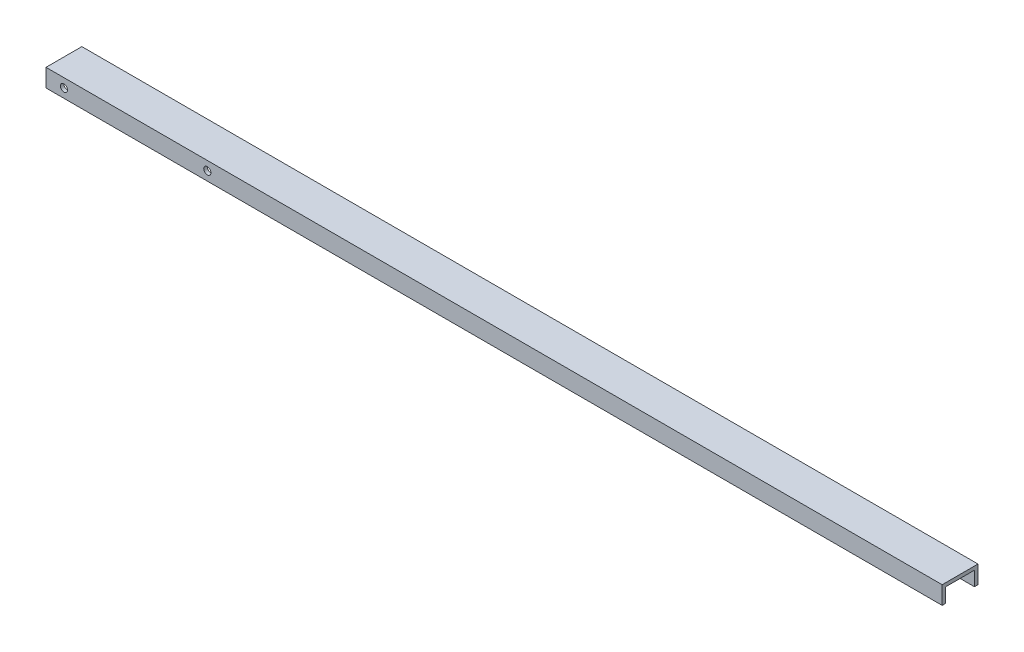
ISO-10303-21;
HEADER;
FILE_DESCRIPTION(('STEP AP214'),'2;1');
FILE_NAME('part.step','',(''),(''),'','','');
FILE_SCHEMA(('AUTOMOTIVE_DESIGN { 1 0 10303 214 1 1 1 1 }'));
ENDSEC;
DATA;
#1=APPLICATION_CONTEXT('core data for automotive mechanical design processes');
#2=APPLICATION_PROTOCOL_DEFINITION('international standard','automotive_design',2000,#1);
#3=PRODUCT_CONTEXT('',#1,'mechanical');
#4=PRODUCT('Part','Part','',(#3));
#5=PRODUCT_RELATED_PRODUCT_CATEGORY('part','',(#4));
#6=PRODUCT_DEFINITION_FORMATION('','',#4);
#7=PRODUCT_DEFINITION_CONTEXT('part definition',#1,'design');
#8=PRODUCT_DEFINITION('design','',#6,#7);
#9=PRODUCT_DEFINITION_SHAPE('','',#8);
#10=(LENGTH_UNIT() NAMED_UNIT(*) SI_UNIT(.MILLI.,.METRE.));
#11=(NAMED_UNIT(*) PLANE_ANGLE_UNIT() SI_UNIT($,.RADIAN.));
#12=(NAMED_UNIT(*) SI_UNIT($,.STERADIAN.) SOLID_ANGLE_UNIT());
#13=UNCERTAINTY_MEASURE_WITH_UNIT(LENGTH_MEASURE(1.E-05),#10,'distance_accuracy_value','');
#14=(GEOMETRIC_REPRESENTATION_CONTEXT(3) GLOBAL_UNCERTAINTY_ASSIGNED_CONTEXT((#13)) GLOBAL_UNIT_ASSIGNED_CONTEXT((#10,
#11,#12)) REPRESENTATION_CONTEXT('',''));
#15=CARTESIAN_POINT('',(0.,0.,0.));
#16=DIRECTION('',(0.,0.,1.));
#17=DIRECTION('',(1.,0.,0.));
#18=AXIS2_PLACEMENT_3D('',#15,#16,#17);
#19=CARTESIAN_POINT('',(0.,0.,508.));
#20=DIRECTION('',(0.,1.,0.));
#21=DIRECTION('',(0.,0.,1.));
#22=AXIS2_PLACEMENT_3D('',#19,#20,#21);
#23=PLANE('',#22);
#24=DIRECTION('',(0.,0.,-1.));
#25=VECTOR('',#24,1.);
#26=CARTESIAN_POINT('',(12700.,0.,508.));
#27=LINE('',#26,#25);
#28=CARTESIAN_POINT('',(12700.,0.,50.8));
#29=VERTEX_POINT('',#28);
#30=CARTESIAN_POINT('',(12700.,0.,0.));
#31=VERTEX_POINT('',#30);
#32=EDGE_CURVE('E438',#29,#31,#27,.T.);
#33=ORIENTED_EDGE('',*,*,#32,.F.);
#34=DIRECTION('',(-1.,0.,0.));
#35=VECTOR('',#34,1.);
#36=CARTESIAN_POINT('',(12700.,0.,50.8));
#37=LINE('',#36,#35);
#38=CARTESIAN_POINT('',(0.,0.,50.8));
#39=VERTEX_POINT('',#38);
#40=EDGE_CURVE('E424',#29,#39,#37,.T.);
#41=ORIENTED_EDGE('',*,*,#40,.T.);
#42=DIRECTION('',(0.,0.,-1.));
#43=VECTOR('',#42,1.);
#44=CARTESIAN_POINT('',(0.,0.,508.));
#45=LINE('',#44,#43);
#46=CARTESIAN_POINT('',(0.,0.,0.));
#47=VERTEX_POINT('',#46);
#48=EDGE_CURVE('E362',#39,#47,#45,.T.);
#49=ORIENTED_EDGE('',*,*,#48,.T.);
#50=DIRECTION('',(1.,0.,0.));
#51=VECTOR('',#50,1.);
#52=CARTESIAN_POINT('',(0.,0.,0.));
#53=LINE('',#52,#51);
#54=EDGE_CURVE('E481',#47,#31,#53,.T.);
#55=ORIENTED_EDGE('',*,*,#54,.T.);
#56=EDGE_LOOP('',(#33,#41,#49,#55));
#57=FACE_BOUND('',#56,.T.);
#58=ADVANCED_FACE('F353',(#57),#23,.F.);
#59=CARTESIAN_POINT('',(0.,0.,508.));
#60=DIRECTION('',(1.,0.,0.));
#61=DIRECTION('',(0.,0.,-1.));
#62=AXIS2_PLACEMENT_3D('',#59,#60,#61);
#63=PLANE('',#62);
#64=ORIENTED_EDGE('',*,*,#48,.F.);
#65=DIRECTION('',(0.,-1.,0.));
#66=VECTOR('',#65,1.);
#67=CARTESIAN_POINT('',(0.,0.,50.8));
#68=LINE('',#67,#66);
#69=CARTESIAN_POINT('',(0.,203.2,50.8));
#70=VERTEX_POINT('',#69);
#71=EDGE_CURVE('E420',#70,#39,#68,.T.);
#72=ORIENTED_EDGE('',*,*,#71,.F.);
#73=DIRECTION('',(0.,0.,-1.));
#74=VECTOR('',#73,1.);
#75=CARTESIAN_POINT('',(0.,203.2,50.8));
#76=LINE('',#75,#74);
#77=CARTESIAN_POINT('',(0.,203.2,457.2));
#78=VERTEX_POINT('',#77);
#79=EDGE_CURVE('E468',#78,#70,#76,.T.);
#80=ORIENTED_EDGE('',*,*,#79,.F.);
#81=DIRECTION('',(0.,1.,0.));
#82=VECTOR('',#81,1.);
#83=CARTESIAN_POINT('',(0.,0.,457.2));
#84=LINE('',#83,#82);
#85=CARTESIAN_POINT('',(0.,0.,457.2));
#86=VERTEX_POINT('',#85);
#87=EDGE_CURVE('E431',#86,#78,#84,.T.);
#88=ORIENTED_EDGE('',*,*,#87,.F.);
#89=CARTESIAN_POINT('',(0.,0.,508.));
#90=VERTEX_POINT('',#89);
#91=EDGE_CURVE('E11',#90,#86,#45,.T.);
#92=ORIENTED_EDGE('',*,*,#91,.F.);
#93=DIRECTION('',(0.,-1.,0.));
#94=VECTOR('',#93,1.);
#95=CARTESIAN_POINT('',(0.,0.,508.));
#96=LINE('',#95,#94);
#97=CARTESIAN_POINT('',(0.,254.,508.));
#98=VERTEX_POINT('',#97);
#99=EDGE_CURVE('E487',#98,#90,#96,.T.);
#100=ORIENTED_EDGE('',*,*,#99,.F.);
#101=DIRECTION('',(0.,0.,-1.));
#102=VECTOR('',#101,1.);
#103=CARTESIAN_POINT('',(0.,254.,508.));
#104=LINE('',#103,#102);
#105=CARTESIAN_POINT('',(0.,254.,0.));
#106=VERTEX_POINT('',#105);
#107=EDGE_CURVE('E494',#98,#106,#104,.T.);
#108=ORIENTED_EDGE('',*,*,#107,.T.);
#109=DIRECTION('',(0.,-1.,0.));
#110=VECTOR('',#109,1.);
#111=CARTESIAN_POINT('',(0.,0.,0.));
#112=LINE('',#111,#110);
#113=EDGE_CURVE('E444',#106,#47,#112,.T.);
#114=ORIENTED_EDGE('',*,*,#113,.T.);
#115=EDGE_LOOP('',(#64,#72,#80,#88,#92,#100,#108,#114));
#116=FACE_BOUND('',#115,.T.);
#117=ADVANCED_FACE('F355',(#116),#63,.F.);
#118=ORIENTED_EDGE('',*,*,#91,.T.);
#119=DIRECTION('',(-1.,0.,0.));
#120=VECTOR('',#119,1.);
#121=CARTESIAN_POINT('',(12700.,0.,457.2));
#122=LINE('',#121,#120);
#123=CARTESIAN_POINT('',(12700.,0.,457.2));
#124=VERTEX_POINT('',#123);
#125=EDGE_CURVE('E439',#124,#86,#122,.T.);
#126=ORIENTED_EDGE('',*,*,#125,.F.);
#127=CARTESIAN_POINT('',(12700.,0.,508.));
#128=VERTEX_POINT('',#127);
#129=EDGE_CURVE('E445',#128,#124,#27,.T.);
#130=ORIENTED_EDGE('',*,*,#129,.F.);
#131=DIRECTION('',(1.,0.,0.));
#132=VECTOR('',#131,1.);
#133=CARTESIAN_POINT('',(0.,0.,508.));
#134=LINE('',#133,#132);
#135=EDGE_CURVE('E489',#90,#128,#134,.T.);
#136=ORIENTED_EDGE('',*,*,#135,.F.);
#137=EDGE_LOOP('',(#118,#126,#130,#136));
#138=FACE_BOUND('',#137,.T.);
#139=ADVANCED_FACE('F514',(#138),#23,.F.);
#140=CARTESIAN_POINT('',(12700.,0.,508.));
#141=DIRECTION('',(-1.,0.,0.));
#142=DIRECTION('',(0.,0.,1.));
#143=AXIS2_PLACEMENT_3D('',#140,#141,#142);
#144=PLANE('',#143);
#145=DIRECTION('',(0.,0.,-1.));
#146=VECTOR('',#145,1.);
#147=CARTESIAN_POINT('',(12700.,203.2,50.8));
#148=LINE('',#147,#146);
#149=CARTESIAN_POINT('',(12700.,203.2,457.2));
#150=VERTEX_POINT('',#149);
#151=CARTESIAN_POINT('',(12700.,203.2,50.8));
#152=VERTEX_POINT('',#151);
#153=EDGE_CURVE('E370',#150,#152,#148,.T.);
#154=ORIENTED_EDGE('',*,*,#153,.T.);
#155=DIRECTION('',(0.,-1.,0.));
#156=VECTOR('',#155,1.);
#157=CARTESIAN_POINT('',(12700.,0.,50.8));
#158=LINE('',#157,#156);
#159=EDGE_CURVE('E470',#152,#29,#158,.T.);
#160=ORIENTED_EDGE('',*,*,#159,.T.);
#161=ORIENTED_EDGE('',*,*,#32,.T.);
#162=DIRECTION('',(0.,1.,0.));
#163=VECTOR('',#162,1.);
#164=CARTESIAN_POINT('',(12700.,0.,0.));
#165=LINE('',#164,#163);
#166=CARTESIAN_POINT('',(12700.,254.,0.));
#167=VERTEX_POINT('',#166);
#168=EDGE_CURVE('E483',#31,#167,#165,.T.);
#169=ORIENTED_EDGE('',*,*,#168,.T.);
#170=DIRECTION('',(0.,0.,-1.));
#171=VECTOR('',#170,1.);
#172=CARTESIAN_POINT('',(12700.,254.,508.));
#173=LINE('',#172,#171);
#174=CARTESIAN_POINT('',(12700.,254.,508.));
#175=VERTEX_POINT('',#174);
#176=EDGE_CURVE('E495',#175,#167,#173,.T.);
#177=ORIENTED_EDGE('',*,*,#176,.F.);
#178=DIRECTION('',(0.,1.,0.));
#179=VECTOR('',#178,1.);
#180=CARTESIAN_POINT('',(12700.,0.,508.));
#181=LINE('',#180,#179);
#182=EDGE_CURVE('E491',#128,#175,#181,.T.);
#183=ORIENTED_EDGE('',*,*,#182,.F.);
#184=ORIENTED_EDGE('',*,*,#129,.T.);
#185=DIRECTION('',(0.,1.,0.));
#186=VECTOR('',#185,1.);
#187=CARTESIAN_POINT('',(12700.,0.,457.2));
#188=LINE('',#187,#186);
#189=EDGE_CURVE('E472',#124,#150,#188,.T.);
#190=ORIENTED_EDGE('',*,*,#189,.T.);
#191=EDGE_LOOP('',(#154,#160,#161,#169,#177,#183,#184,#190));
#192=FACE_BOUND('',#191,.T.);
#193=ADVANCED_FACE('F501',(#192),#144,.F.);
#194=CARTESIAN_POINT('',(0.,254.,508.));
#195=DIRECTION('',(0.,-1.,0.));
#196=DIRECTION('',(0.,0.,-1.));
#197=AXIS2_PLACEMENT_3D('',#194,#195,#196);
#198=PLANE('',#197);
#199=DIRECTION('',(-1.,0.,0.));
#200=VECTOR('',#199,1.);
#201=CARTESIAN_POINT('',(0.,254.,0.));
#202=LINE('',#201,#200);
#203=EDGE_CURVE('E485',#167,#106,#202,.T.);
#204=ORIENTED_EDGE('',*,*,#203,.T.);
#205=ORIENTED_EDGE('',*,*,#107,.F.);
#206=DIRECTION('',(-1.,0.,0.));
#207=VECTOR('',#206,1.);
#208=CARTESIAN_POINT('',(0.,254.,508.));
#209=LINE('',#208,#207);
#210=EDGE_CURVE('E378',#175,#98,#209,.T.);
#211=ORIENTED_EDGE('',*,*,#210,.F.);
#212=ORIENTED_EDGE('',*,*,#176,.T.);
#213=EDGE_LOOP('',(#204,#205,#211,#212));
#214=FACE_BOUND('',#213,.T.);
#215=ADVANCED_FACE('F505',(#214),#198,.F.);
#216=CARTESIAN_POINT('',(0.,254.,508.));
#217=DIRECTION('',(0.,0.,-1.));
#218=DIRECTION('',(-1.,0.,0.));
#219=AXIS2_PLACEMENT_3D('',#216,#217,#218);
#220=PLANE('',#219);
#221=CARTESIAN_POINT('',(2286.,127.,508.));
#222=DIRECTION('',(0.,0.,1.));
#223=DIRECTION('',(1.,0.,0.));
#224=AXIS2_PLACEMENT_3D('',#221,#222,#223);
#225=CIRCLE('',#224,50.8);
#226=CARTESIAN_POINT('',(2336.8,127.,508.));
#227=VERTEX_POINT('',#226);
#228=EDGE_CURVE('E555',#227,#227,#225,.T.);
#229=ORIENTED_EDGE('',*,*,#228,.F.);
#230=EDGE_LOOP('',(#229));
#231=FACE_BOUND('',#230,.T.);
#232=CARTESIAN_POINT('',(254.,127.,508.));
#233=DIRECTION('',(0.,0.,1.));
#234=DIRECTION('',(1.,0.,0.));
#235=AXIS2_PLACEMENT_3D('',#232,#233,#234);
#236=CIRCLE('',#235,50.8);
#237=CARTESIAN_POINT('',(304.8,127.,508.));
#238=VERTEX_POINT('',#237);
#239=EDGE_CURVE('E457',#238,#238,#236,.T.);
#240=ORIENTED_EDGE('',*,*,#239,.F.);
#241=EDGE_LOOP('',(#240));
#242=FACE_BOUND('',#241,.T.);
#243=ORIENTED_EDGE('',*,*,#99,.T.);
#244=ORIENTED_EDGE('',*,*,#135,.T.);
#245=ORIENTED_EDGE('',*,*,#182,.T.);
#246=ORIENTED_EDGE('',*,*,#210,.T.);
#247=EDGE_LOOP('',(#243,#244,#245,#246));
#248=FACE_BOUND('',#247,.T.);
#249=ADVANCED_FACE('F509',(#231,#242,#248),#220,.F.);
#250=CARTESIAN_POINT('',(0.,254.,0.));
#251=DIRECTION('',(0.,0.,-1.));
#252=DIRECTION('',(-1.,0.,0.));
#253=AXIS2_PLACEMENT_3D('',#250,#251,#252);
#254=PLANE('',#253);
#255=CARTESIAN_POINT('',(2286.,127.,0.));
#256=DIRECTION('',(0.,0.,1.));
#257=DIRECTION('',(1.,0.,0.));
#258=AXIS2_PLACEMENT_3D('',#255,#256,#257);
#259=CIRCLE('',#258,50.8);
#260=CARTESIAN_POINT('',(2336.8,127.,0.));
#261=VERTEX_POINT('',#260);
#262=EDGE_CURVE('E553',#261,#261,#259,.T.);
#263=ORIENTED_EDGE('',*,*,#262,.T.);
#264=EDGE_LOOP('',(#263));
#265=FACE_BOUND('',#264,.T.);
#266=CARTESIAN_POINT('',(254.,127.,0.));
#267=DIRECTION('',(0.,0.,1.));
#268=DIRECTION('',(1.,0.,0.));
#269=AXIS2_PLACEMENT_3D('',#266,#267,#268);
#270=CIRCLE('',#269,50.8);
#271=CARTESIAN_POINT('',(304.8,127.,0.));
#272=VERTEX_POINT('',#271);
#273=EDGE_CURVE('E451',#272,#272,#270,.T.);
#274=ORIENTED_EDGE('',*,*,#273,.T.);
#275=EDGE_LOOP('',(#274));
#276=FACE_BOUND('',#275,.T.);
#277=ORIENTED_EDGE('',*,*,#113,.F.);
#278=ORIENTED_EDGE('',*,*,#203,.F.);
#279=ORIENTED_EDGE('',*,*,#168,.F.);
#280=ORIENTED_EDGE('',*,*,#54,.F.);
#281=EDGE_LOOP('',(#277,#278,#279,#280));
#282=FACE_BOUND('',#281,.T.);
#283=ADVANCED_FACE('F504',(#265,#276,#282),#254,.T.);
#284=CARTESIAN_POINT('',(12700.,0.,50.8));
#285=DIRECTION('',(0.,0.,-1.));
#286=DIRECTION('',(0.,1.,0.));
#287=AXIS2_PLACEMENT_3D('',#284,#285,#286);
#288=PLANE('',#287);
#289=CARTESIAN_POINT('',(2286.,127.,50.8));
#290=DIRECTION('',(0.,0.,-1.));
#291=DIRECTION('',(0.,1.,0.));
#292=AXIS2_PLACEMENT_3D('',#289,#290,#291);
#293=CIRCLE('',#292,50.8);
#294=CARTESIAN_POINT('',(2286.,177.8,50.8));
#295=VERTEX_POINT('',#294);
#296=EDGE_CURVE('E462',#295,#295,#293,.T.);
#297=ORIENTED_EDGE('',*,*,#296,.T.);
#298=EDGE_LOOP('',(#297));
#299=FACE_BOUND('',#298,.T.);
#300=CARTESIAN_POINT('',(254.,127.,50.8));
#301=DIRECTION('',(0.,0.,-1.));
#302=DIRECTION('',(0.,1.,0.));
#303=AXIS2_PLACEMENT_3D('',#300,#301,#302);
#304=CIRCLE('',#303,50.8);
#305=CARTESIAN_POINT('',(254.,177.8,50.8));
#306=VERTEX_POINT('',#305);
#307=EDGE_CURVE('E432',#306,#306,#304,.T.);
#308=ORIENTED_EDGE('',*,*,#307,.T.);
#309=EDGE_LOOP('',(#308));
#310=FACE_BOUND('',#309,.T.);
#311=ORIENTED_EDGE('',*,*,#71,.T.);
#312=ORIENTED_EDGE('',*,*,#40,.F.);
#313=ORIENTED_EDGE('',*,*,#159,.F.);
#314=DIRECTION('',(-1.,0.,0.));
#315=VECTOR('',#314,1.);
#316=CARTESIAN_POINT('',(12700.,203.2,50.8));
#317=LINE('',#316,#315);
#318=EDGE_CURVE('E426',#152,#70,#317,.T.);
#319=ORIENTED_EDGE('',*,*,#318,.T.);
#320=EDGE_LOOP('',(#311,#312,#313,#319));
#321=FACE_BOUND('',#320,.T.);
#322=ADVANCED_FACE('F422',(#299,#310,#321),#288,.F.);
#323=CARTESIAN_POINT('',(12700.,203.2,50.8));
#324=DIRECTION('',(0.,1.,0.));
#325=DIRECTION('',(0.,0.,1.));
#326=AXIS2_PLACEMENT_3D('',#323,#324,#325);
#327=PLANE('',#326);
#328=ORIENTED_EDGE('',*,*,#79,.T.);
#329=ORIENTED_EDGE('',*,*,#318,.F.);
#330=ORIENTED_EDGE('',*,*,#153,.F.);
#331=DIRECTION('',(-1.,0.,0.));
#332=VECTOR('',#331,1.);
#333=CARTESIAN_POINT('',(12700.,203.2,457.2));
#334=LINE('',#333,#332);
#335=EDGE_CURVE('E477',#150,#78,#334,.T.);
#336=ORIENTED_EDGE('',*,*,#335,.T.);
#337=EDGE_LOOP('',(#328,#329,#330,#336));
#338=FACE_BOUND('',#337,.T.);
#339=ADVANCED_FACE('F517',(#338),#327,.F.);
#340=CARTESIAN_POINT('',(12700.,0.,457.2));
#341=DIRECTION('',(0.,0.,1.));
#342=DIRECTION('',(1.,0.,0.));
#343=AXIS2_PLACEMENT_3D('',#340,#341,#342);
#344=PLANE('',#343);
#345=CARTESIAN_POINT('',(2286.,127.,457.2));
#346=DIRECTION('',(0.,0.,1.));
#347=DIRECTION('',(1.,0.,0.));
#348=AXIS2_PLACEMENT_3D('',#345,#346,#347);
#349=CIRCLE('',#348,50.8);
#350=CARTESIAN_POINT('',(2336.8,127.,457.2));
#351=VERTEX_POINT('',#350);
#352=EDGE_CURVE('E357',#351,#351,#349,.T.);
#353=ORIENTED_EDGE('',*,*,#352,.T.);
#354=EDGE_LOOP('',(#353));
#355=FACE_BOUND('',#354,.T.);
#356=CARTESIAN_POINT('',(254.,127.,457.2));
#357=DIRECTION('',(0.,0.,1.));
#358=DIRECTION('',(1.,0.,0.));
#359=AXIS2_PLACEMENT_3D('',#356,#357,#358);
#360=CIRCLE('',#359,50.8);
#361=CARTESIAN_POINT('',(304.8,127.,457.2));
#362=VERTEX_POINT('',#361);
#363=EDGE_CURVE('E449',#362,#362,#360,.T.);
#364=ORIENTED_EDGE('',*,*,#363,.T.);
#365=EDGE_LOOP('',(#364));
#366=FACE_BOUND('',#365,.T.);
#367=ORIENTED_EDGE('',*,*,#87,.T.);
#368=ORIENTED_EDGE('',*,*,#335,.F.);
#369=ORIENTED_EDGE('',*,*,#189,.F.);
#370=ORIENTED_EDGE('',*,*,#125,.T.);
#371=EDGE_LOOP('',(#367,#368,#369,#370));
#372=FACE_BOUND('',#371,.T.);
#373=ADVANCED_FACE('F516',(#355,#366,#372),#344,.F.);
#374=CARTESIAN_POINT('',(254.,127.,0.));
#375=DIRECTION('',(0.,0.,1.));
#376=DIRECTION('',(1.,0.,0.));
#377=AXIS2_PLACEMENT_3D('',#374,#375,#376);
#378=CYLINDRICAL_SURFACE('',#377,50.8);
#379=ORIENTED_EDGE('',*,*,#239,.T.);
#380=EDGE_LOOP('',(#379));
#381=FACE_BOUND('',#380,.T.);
#382=ORIENTED_EDGE('',*,*,#363,.F.);
#383=EDGE_LOOP('',(#382));
#384=FACE_BOUND('',#383,.T.);
#385=ADVANCED_FACE('F525',(#381,#384),#378,.F.);
#386=ORIENTED_EDGE('',*,*,#273,.F.);
#387=EDGE_LOOP('',(#386));
#388=FACE_BOUND('',#387,.T.);
#389=ORIENTED_EDGE('',*,*,#307,.F.);
#390=EDGE_LOOP('',(#389));
#391=FACE_BOUND('',#390,.T.);
#392=ADVANCED_FACE('F571',(#388,#391),#378,.F.);
#393=CARTESIAN_POINT('',(2286.,127.,0.));
#394=DIRECTION('',(0.,0.,1.));
#395=DIRECTION('',(1.,0.,0.));
#396=AXIS2_PLACEMENT_3D('',#393,#394,#395);
#397=CYLINDRICAL_SURFACE('',#396,50.8);
#398=ORIENTED_EDGE('',*,*,#228,.T.);
#399=EDGE_LOOP('',(#398));
#400=FACE_BOUND('',#399,.T.);
#401=ORIENTED_EDGE('',*,*,#352,.F.);
#402=EDGE_LOOP('',(#401));
#403=FACE_BOUND('',#402,.T.);
#404=ADVANCED_FACE('F566',(#400,#403),#397,.F.);
#405=ORIENTED_EDGE('',*,*,#262,.F.);
#406=EDGE_LOOP('',(#405));
#407=FACE_BOUND('',#406,.T.);
#408=ORIENTED_EDGE('',*,*,#296,.F.);
#409=EDGE_LOOP('',(#408));
#410=FACE_BOUND('',#409,.T.);
#411=ADVANCED_FACE('F564',(#407,#410),#397,.F.);
#412=CLOSED_SHELL('',(#58,#117,#139,#193,#215,#249,#283,#322,#339,#373,#385,#392,#404,#411));
#413=MANIFOLD_SOLID_BREP('B2',#412);
#414=ADVANCED_BREP_SHAPE_REPRESENTATION('',(#18,#413),#14);
#415=SHAPE_DEFINITION_REPRESENTATION(#9,#414);
ENDSEC;
END-ISO-10303-21;
